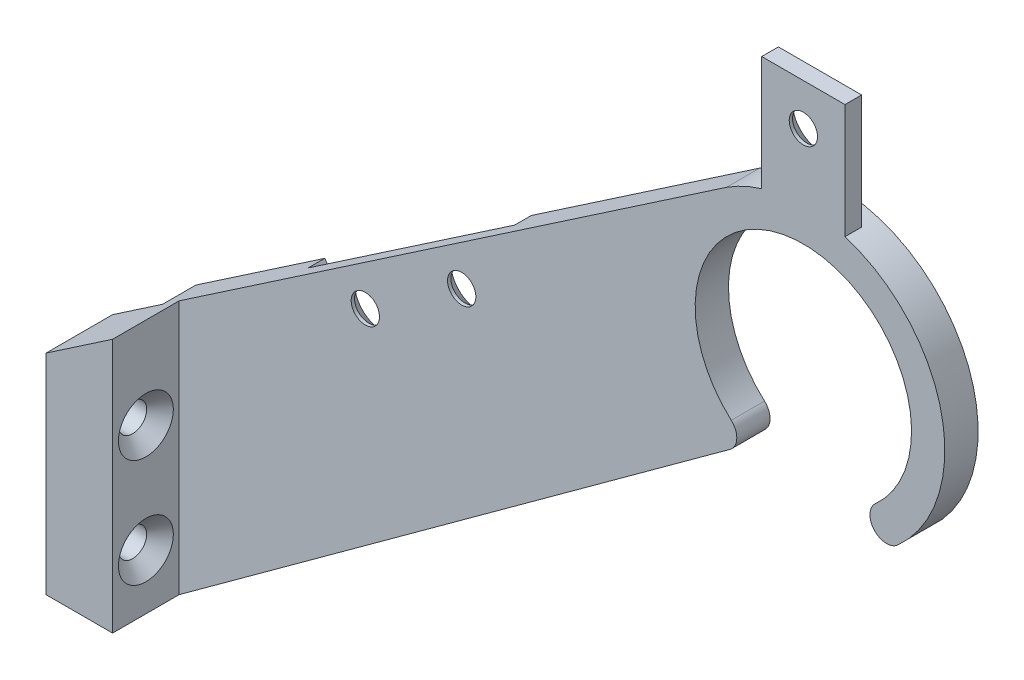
from build123d import *

# Parameters (mm, degrees)
EXTRUDE_1_DEPTH              = 4
EXTRUDE_2_DEPTH              = 8
HOLE_WIZARD_M3_1_D           = 3.4
HOLE_WIZARD_M3_1_CSINK_D     = 6.6
HOLE_WIZARD_M3_1_CSINK_ANGLE = 90
CUT_EXTRUDE_1_DEPTH          = 2
HOLE_WIZARD_M3_2_D           = 3.4
HOLE_WIZARD_M3_2_CSINK_D     = 6.6
HOLE_WIZARD_M3_2_CSINK_ANGLE = 90
EXTRUDE_START                = -4
EXTRUDE_3_DEPTH              = 2
HOLE_WIZARD_M3_3_D           = 3.4
HOLE_WIZARD_M3_3_CSINK_D     = 6.6
HOLE_WIZARD_M3_3_CSINK_ANGLE = 90
SKETCH_11_W                  = 12.98021178
SKETCH_11_H                  = 40
CUT_EXTRUDE_2_DEPTH          = 4


with BuildPart() as part:
    # Sketch 1 → Extrude 1 (new body)
    with BuildSketch(Plane.XY):
        with BuildLine():
            Line((-6, 12.639352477), (-6, -12.5))
            Line((-6, -12.5), (2, -12.5))
            Line((2, -12.5), (68.17752444, 35.703047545))
            ThreePointArc((68.17752444, 35.703047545), (68.997490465, 37.219501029), (68.333333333, 38.810372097))
            ThreePointArc((68.333333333, 38.810372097), (77, 61.5), (85.666666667, 38.810372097))
            ThreePointArc((85.666666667, 38.810372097), (85.509288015, 35.986326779), (88.333333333, 35.828948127))
            ThreePointArc((88.333333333, 35.828948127), (90.514788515, 58.812637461), (67.770637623, 62.776514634))
            Line((67.770637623, 62.776514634), (-6, 12.639352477))
        make_face()
    extrude(amount=EXTRUDE_1_DEPTH)

    # Sketch 2 → Extrude 2 (add)
    with BuildSketch(Plane.XY.offset(4)):
        Polygon((2, 12.639352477), (2, 18.076438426), (-6, 12.639352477), (-6, -12.5), (2, -12.5), align=None)
    extrude(amount=EXTRUDE_2_DEPTH)

    # Hole Wizard M3 _1 (through all)
    with Locations(Plane(origin=(2, 0, 0), x_dir=(0, 0, -1), z_dir=(1, 0, 0))):
        with Locations((-8, 7.139352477), (-8, -5.860647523)):
            CounterSinkHole(HOLE_WIZARD_M3_1_D / 2, HOLE_WIZARD_M3_1_CSINK_D / 2, counter_sink_angle=HOLE_WIZARD_M3_1_CSINK_ANGLE)

    # Sketch 5 → Cut-Extrude 1 (cut)
    with BuildSketch(Plane(origin=(0, 0, 0), x_dir=(-1, 0, 0), z_dir=(0, 0, -1))):
        Polygon((-40.315164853, 44.116793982), (-15.503168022, 27.253674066), (-20, 20.637141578), (-44.81199683, 37.500261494), align=None)
    extrude(amount=-CUT_EXTRUDE_1_DEPTH, mode=Mode.SUBTRACT)

    # Hole Wizard M3 _2 (through all)
    with Locations(Plane(origin=(0, 0, 2), x_dir=(-1, 0, 0), z_dir=(0, 0, -1))):
        with Locations((-35.947048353, 36.311695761), (-24.368116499, 28.4422398)):
            CounterSinkHole(HOLE_WIZARD_M3_2_D / 2, HOLE_WIZARD_M3_2_CSINK_D / 2, counter_sink_angle=HOLE_WIZARD_M3_2_CSINK_ANGLE)

    # Sketch 8 → Extrude 3 (add)
    with BuildSketch(Plane(origin=(0, 0, 0), x_dir=(-1, 0, 0), z_dir=(0, 0, -1)).offset(EXTRUDE_START)):
        with BuildLine():
            Line((-82, 64.743012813), (-82, 78.5))
            Line((-82, 78.5), (-72, 78.5))
            Line((-72, 78.5), (-72, 64.743012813))
            ThreePointArc((-72, 64.743012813), (-77, 65.495160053), (-82, 64.743012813))
        make_face()
    extrude(amount=EXTRUDE_3_DEPTH)

    # Hole Wizard M3 _3 (through all)
    with Locations(Plane(origin=(0, 0, 2), x_dir=(-1, 0, 0), z_dir=(0, 0, -1))):
        with Locations((-77, 73.5)):
            CounterSinkHole(HOLE_WIZARD_M3_3_D / 2, HOLE_WIZARD_M3_3_CSINK_D / 2, counter_sink_angle=HOLE_WIZARD_M3_3_CSINK_ANGLE)

    # Sketch 11 → Cut-Extrude 2 (cut)
    with BuildSketch(Plane(origin=(0, 0, 0), x_dir=(-1, 0, 0), z_dir=(0, 0, -1))):
        with Locations((6.49010589, -3.282833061)):
            Rectangle(SKETCH_11_W, SKETCH_11_H)
    extrude(amount=-CUT_EXTRUDE_2_DEPTH, mode=Mode.SUBTRACT)


solid = part.part
